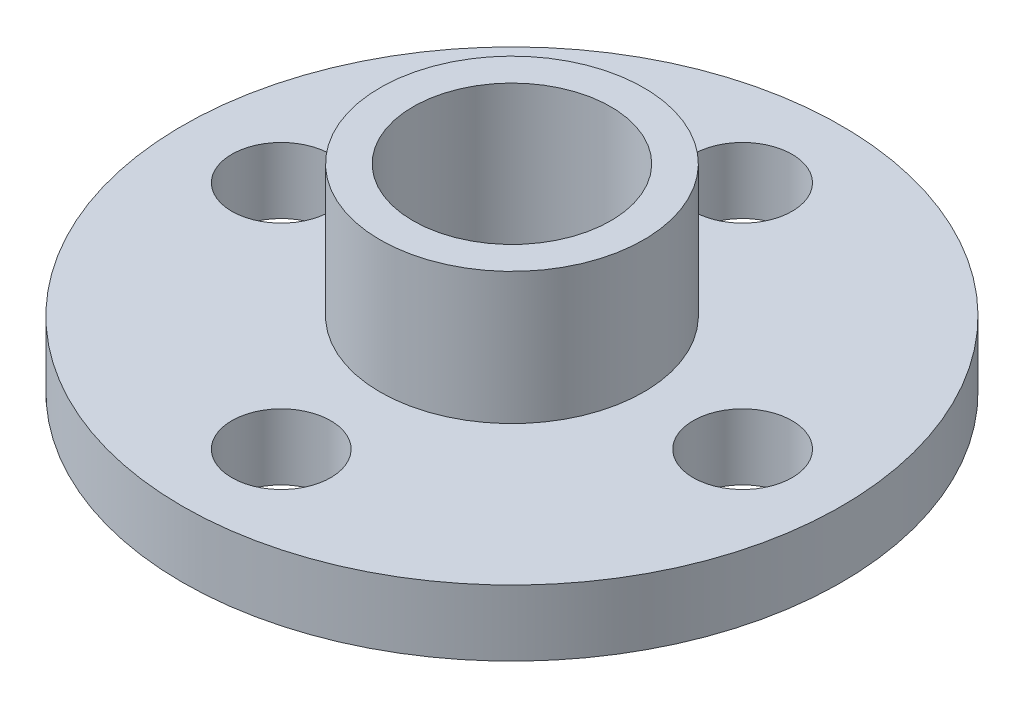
from build123d import *

# Parameters (mm, degrees)
SKETCH1_R           = 10
SKETCH1_R_2         = 1.5
BOSS_EXTRUDE1_DEPTH = 2
SKETCH2_R           = 4
SKETCH2_R_2         = 3
BOSS_EXTRUDE2_DEPTH = 4
CUT_EXTRUDE1_START  = -4
SKETCH3_R           = 3
CUT_EXTRUDE1_DEPTH  = 4


with BuildPart() as part:
    # Sketch1 → Boss-Extrude1 (new body)
    with BuildSketch(Plane(origin=(0, 0, 0), x_dir=(1, 0, 0), z_dir=(0, 1, 0))):
        with Locations(Location((0, 0, 0), (0, 0, 270))):
            Circle(SKETCH1_R)
        with Locations(Location((0, 7, 0), (0, 0, 270))):
            Circle(SKETCH1_R_2, mode=Mode.SUBTRACT)
        with Locations(Location((7, 0, 0), (0, 0, 270))):
            Circle(SKETCH1_R_2, mode=Mode.SUBTRACT)
        with Locations(Location((0, -7, 0), (0, 0, 270))):
            Circle(SKETCH1_R_2, mode=Mode.SUBTRACT)
        with Locations(Location((-7, 0, 0), (0, 0, 270))):
            Circle(SKETCH1_R_2, mode=Mode.SUBTRACT)
    extrude(amount=BOSS_EXTRUDE1_DEPTH)

    # Sketch2 → Boss-Extrude2 (add)
    with BuildSketch(Plane(origin=(0, 2, 0), x_dir=(1, 0, 0), z_dir=(0, 1, 0))):
        with Locations(Location((0, 0, 0), (0, 0, 270))):
            Circle(SKETCH2_R)
        with Locations(Location((0, 0, 0), (0, 0, 270))):
            Circle(SKETCH2_R_2, mode=Mode.SUBTRACT)
    extrude(amount=BOSS_EXTRUDE2_DEPTH)

    # Sketch3 → Cut-Extrude1 (cut)
    with BuildSketch(Plane(origin=(0, 2, 0), x_dir=(1, 0, 0), z_dir=(0, 1, 0)).offset(CUT_EXTRUDE1_START)):
        with Locations(Location((0, 0, 0), (0, 0, 270))):
            Circle(SKETCH3_R)
    extrude(amount=CUT_EXTRUDE1_DEPTH, mode=Mode.SUBTRACT)


solid = part.part
